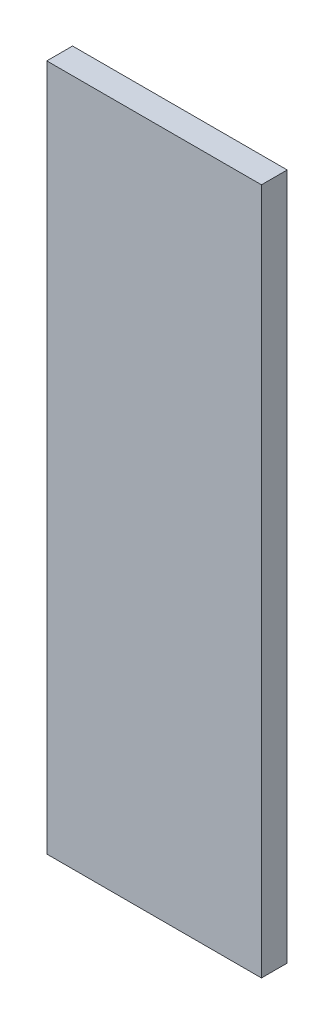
ISO-10303-21;
HEADER;
FILE_DESCRIPTION(('STEP AP214'),'2;1');
FILE_NAME('part.step','',(''),(''),'','','');
FILE_SCHEMA(('AUTOMOTIVE_DESIGN { 1 0 10303 214 1 1 1 1 }'));
ENDSEC;
DATA;
#1=APPLICATION_CONTEXT('core data for automotive mechanical design processes');
#2=APPLICATION_PROTOCOL_DEFINITION('international standard','automotive_design',2000,#1);
#3=PRODUCT_CONTEXT('',#1,'mechanical');
#4=PRODUCT('Part','Part','',(#3));
#5=PRODUCT_RELATED_PRODUCT_CATEGORY('part','',(#4));
#6=PRODUCT_DEFINITION_FORMATION('','',#4);
#7=PRODUCT_DEFINITION_CONTEXT('part definition',#1,'design');
#8=PRODUCT_DEFINITION('design','',#6,#7);
#9=PRODUCT_DEFINITION_SHAPE('','',#8);
#10=(LENGTH_UNIT() NAMED_UNIT(*) SI_UNIT(.MILLI.,.METRE.));
#11=(NAMED_UNIT(*) PLANE_ANGLE_UNIT() SI_UNIT($,.RADIAN.));
#12=(NAMED_UNIT(*) SI_UNIT($,.STERADIAN.) SOLID_ANGLE_UNIT());
#13=UNCERTAINTY_MEASURE_WITH_UNIT(LENGTH_MEASURE(1.E-05),#10,'distance_accuracy_value','');
#14=(GEOMETRIC_REPRESENTATION_CONTEXT(3) GLOBAL_UNCERTAINTY_ASSIGNED_CONTEXT((#13)) GLOBAL_UNIT_ASSIGNED_CONTEXT((#10,
#11,#12)) REPRESENTATION_CONTEXT('',''));
#15=CARTESIAN_POINT('',(0.,0.,0.));
#16=DIRECTION('',(0.,0.,1.));
#17=DIRECTION('',(1.,0.,0.));
#18=AXIS2_PLACEMENT_3D('',#15,#16,#17);
#19=CARTESIAN_POINT('',(0.,0.,30.));
#20=DIRECTION('',(0.,0.,1.));
#21=DIRECTION('',(1.,0.,0.));
#22=AXIS2_PLACEMENT_3D('',#19,#20,#21);
#23=PLANE('',#22);
#24=DIRECTION('',(1.,0.,0.));
#25=VECTOR('',#24,1.);
#26=CARTESIAN_POINT('',(-125.,-400.,30.));
#27=LINE('',#26,#25);
#28=CARTESIAN_POINT('',(-125.,-400.,30.));
#29=VERTEX_POINT('',#28);
#30=CARTESIAN_POINT('',(125.,-400.,30.));
#31=VERTEX_POINT('',#30);
#32=EDGE_CURVE('E81',#29,#31,#27,.T.);
#33=ORIENTED_EDGE('',*,*,#32,.T.);
#34=DIRECTION('',(0.,1.,0.));
#35=VECTOR('',#34,1.);
#36=CARTESIAN_POINT('',(125.,-400.,30.));
#37=LINE('',#36,#35);
#38=CARTESIAN_POINT('',(125.,400.,30.));
#39=VERTEX_POINT('',#38);
#40=EDGE_CURVE('E101',#31,#39,#37,.T.);
#41=ORIENTED_EDGE('',*,*,#40,.T.);
#42=DIRECTION('',(-1.,0.,0.));
#43=VECTOR('',#42,1.);
#44=CARTESIAN_POINT('',(125.,400.,30.));
#45=LINE('',#44,#43);
#46=CARTESIAN_POINT('',(-125.,400.,30.));
#47=VERTEX_POINT('',#46);
#48=EDGE_CURVE('E73',#39,#47,#45,.T.);
#49=ORIENTED_EDGE('',*,*,#48,.T.);
#50=DIRECTION('',(0.,-1.,0.));
#51=VECTOR('',#50,1.);
#52=CARTESIAN_POINT('',(-125.,400.,30.));
#53=LINE('',#52,#51);
#54=EDGE_CURVE('E10',#47,#29,#53,.T.);
#55=ORIENTED_EDGE('',*,*,#54,.T.);
#56=EDGE_LOOP('',(#33,#41,#49,#55));
#57=FACE_BOUND('',#56,.T.);
#58=ADVANCED_FACE('F16',(#57),#23,.T.);
#59=CARTESIAN_POINT('',(0.,0.,0.));
#60=DIRECTION('',(0.,0.,1.));
#61=DIRECTION('',(1.,0.,0.));
#62=AXIS2_PLACEMENT_3D('',#59,#60,#61);
#63=PLANE('',#62);
#64=DIRECTION('',(0.,-1.,0.));
#65=VECTOR('',#64,1.);
#66=CARTESIAN_POINT('',(-125.,400.,0.));
#67=LINE('',#66,#65);
#68=CARTESIAN_POINT('',(-125.,400.,0.));
#69=VERTEX_POINT('',#68);
#70=CARTESIAN_POINT('',(-125.,-400.,0.));
#71=VERTEX_POINT('',#70);
#72=EDGE_CURVE('E25',#69,#71,#67,.T.);
#73=ORIENTED_EDGE('',*,*,#72,.F.);
#74=DIRECTION('',(-1.,0.,0.));
#75=VECTOR('',#74,1.);
#76=CARTESIAN_POINT('',(125.,400.,0.));
#77=LINE('',#76,#75);
#78=CARTESIAN_POINT('',(125.,400.,0.));
#79=VERTEX_POINT('',#78);
#80=EDGE_CURVE('E107',#79,#69,#77,.T.);
#81=ORIENTED_EDGE('',*,*,#80,.F.);
#82=DIRECTION('',(0.,1.,0.));
#83=VECTOR('',#82,1.);
#84=CARTESIAN_POINT('',(125.,-400.,0.));
#85=LINE('',#84,#83);
#86=CARTESIAN_POINT('',(125.,-400.,0.));
#87=VERTEX_POINT('',#86);
#88=EDGE_CURVE('E83',#87,#79,#85,.T.);
#89=ORIENTED_EDGE('',*,*,#88,.F.);
#90=DIRECTION('',(1.,0.,0.));
#91=VECTOR('',#90,1.);
#92=CARTESIAN_POINT('',(-125.,-400.,0.));
#93=LINE('',#92,#91);
#94=EDGE_CURVE('E79',#71,#87,#93,.T.);
#95=ORIENTED_EDGE('',*,*,#94,.F.);
#96=EDGE_LOOP('',(#73,#81,#89,#95));
#97=FACE_BOUND('',#96,.T.);
#98=ADVANCED_FACE('F85',(#97),#63,.F.);
#99=CARTESIAN_POINT('',(-125.,400.,0.));
#100=DIRECTION('',(1.,0.,0.));
#101=DIRECTION('',(0.,1.,0.));
#102=AXIS2_PLACEMENT_3D('',#99,#100,#101);
#103=PLANE('',#102);
#104=ORIENTED_EDGE('',*,*,#72,.T.);
#105=DIRECTION('',(0.,0.,1.));
#106=VECTOR('',#105,1.);
#107=CARTESIAN_POINT('',(-125.,-400.,0.));
#108=LINE('',#107,#106);
#109=EDGE_CURVE('E67',#71,#29,#108,.T.);
#110=ORIENTED_EDGE('',*,*,#109,.T.);
#111=ORIENTED_EDGE('',*,*,#54,.F.);
#112=DIRECTION('',(0.,0.,1.));
#113=VECTOR('',#112,1.);
#114=CARTESIAN_POINT('',(-125.,400.,0.));
#115=LINE('',#114,#113);
#116=EDGE_CURVE('E70',#69,#47,#115,.T.);
#117=ORIENTED_EDGE('',*,*,#116,.F.);
#118=EDGE_LOOP('',(#104,#110,#111,#117));
#119=FACE_BOUND('',#118,.T.);
#120=ADVANCED_FACE('F18',(#119),#103,.F.);
#121=CARTESIAN_POINT('',(125.,400.,0.));
#122=DIRECTION('',(0.,-1.,0.));
#123=DIRECTION('',(0.,0.,-1.));
#124=AXIS2_PLACEMENT_3D('',#121,#122,#123);
#125=PLANE('',#124);
#126=ORIENTED_EDGE('',*,*,#80,.T.);
#127=ORIENTED_EDGE('',*,*,#116,.T.);
#128=ORIENTED_EDGE('',*,*,#48,.F.);
#129=DIRECTION('',(0.,0.,1.));
#130=VECTOR('',#129,1.);
#131=CARTESIAN_POINT('',(125.,400.,0.));
#132=LINE('',#131,#130);
#133=EDGE_CURVE('E97',#79,#39,#132,.T.);
#134=ORIENTED_EDGE('',*,*,#133,.F.);
#135=EDGE_LOOP('',(#126,#127,#128,#134));
#136=FACE_BOUND('',#135,.T.);
#137=ADVANCED_FACE('F114',(#136),#125,.F.);
#138=CARTESIAN_POINT('',(125.,-400.,0.));
#139=DIRECTION('',(-1.,0.,0.));
#140=DIRECTION('',(0.,0.,1.));
#141=AXIS2_PLACEMENT_3D('',#138,#139,#140);
#142=PLANE('',#141);
#143=ORIENTED_EDGE('',*,*,#88,.T.);
#144=ORIENTED_EDGE('',*,*,#133,.T.);
#145=ORIENTED_EDGE('',*,*,#40,.F.);
#146=DIRECTION('',(0.,0.,1.));
#147=VECTOR('',#146,1.);
#148=CARTESIAN_POINT('',(125.,-400.,0.));
#149=LINE('',#148,#147);
#150=EDGE_CURVE('E89',#87,#31,#149,.T.);
#151=ORIENTED_EDGE('',*,*,#150,.F.);
#152=EDGE_LOOP('',(#143,#144,#145,#151));
#153=FACE_BOUND('',#152,.T.);
#154=ADVANCED_FACE('F117',(#153),#142,.F.);
#155=CARTESIAN_POINT('',(-125.,-400.,0.));
#156=DIRECTION('',(0.,1.,0.));
#157=DIRECTION('',(1.,0.,0.));
#158=AXIS2_PLACEMENT_3D('',#155,#156,#157);
#159=PLANE('',#158);
#160=ORIENTED_EDGE('',*,*,#94,.T.);
#161=ORIENTED_EDGE('',*,*,#150,.T.);
#162=ORIENTED_EDGE('',*,*,#32,.F.);
#163=ORIENTED_EDGE('',*,*,#109,.F.);
#164=EDGE_LOOP('',(#160,#161,#162,#163));
#165=FACE_BOUND('',#164,.T.);
#166=ADVANCED_FACE('F77',(#165),#159,.F.);
#167=CLOSED_SHELL('',(#58,#98,#120,#137,#154,#166));
#168=MANIFOLD_SOLID_BREP('B1',#167);
#169=ADVANCED_BREP_SHAPE_REPRESENTATION('',(#18,#168),#14);
#170=SHAPE_DEFINITION_REPRESENTATION(#9,#169);
ENDSEC;
END-ISO-10303-21;
